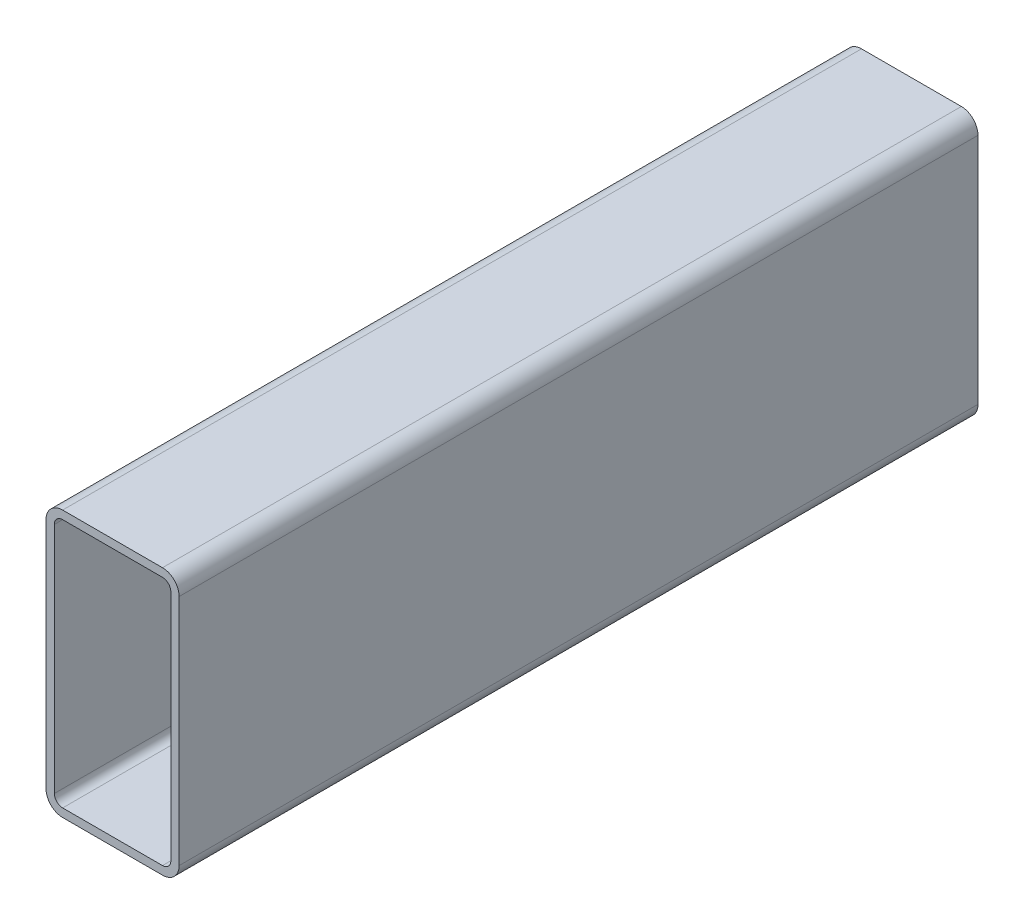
ISO-10303-21;
HEADER;
FILE_DESCRIPTION(('STEP AP214'),'2;1');
FILE_NAME('part.step','',(''),(''),'','','');
FILE_SCHEMA(('AUTOMOTIVE_DESIGN { 1 0 10303 214 1 1 1 1 }'));
ENDSEC;
DATA;
#1=APPLICATION_CONTEXT('core data for automotive mechanical design processes');
#2=APPLICATION_PROTOCOL_DEFINITION('international standard','automotive_design',2000,#1);
#3=PRODUCT_CONTEXT('',#1,'mechanical');
#4=PRODUCT('Part','Part','',(#3));
#5=PRODUCT_RELATED_PRODUCT_CATEGORY('part','',(#4));
#6=PRODUCT_DEFINITION_FORMATION('','',#4);
#7=PRODUCT_DEFINITION_CONTEXT('part definition',#1,'design');
#8=PRODUCT_DEFINITION('design','',#6,#7);
#9=PRODUCT_DEFINITION_SHAPE('','',#8);
#10=(LENGTH_UNIT() NAMED_UNIT(*) SI_UNIT(.MILLI.,.METRE.));
#11=(NAMED_UNIT(*) PLANE_ANGLE_UNIT() SI_UNIT($,.RADIAN.));
#12=(NAMED_UNIT(*) SI_UNIT($,.STERADIAN.) SOLID_ANGLE_UNIT());
#13=UNCERTAINTY_MEASURE_WITH_UNIT(LENGTH_MEASURE(1.E-05),#10,'distance_accuracy_value','');
#14=(GEOMETRIC_REPRESENTATION_CONTEXT(3) GLOBAL_UNCERTAINTY_ASSIGNED_CONTEXT((#13)) GLOBAL_UNIT_ASSIGNED_CONTEXT((#10,
#11,#12)) REPRESENTATION_CONTEXT('',''));
#15=CARTESIAN_POINT('',(0.,0.,0.));
#16=DIRECTION('',(0.,0.,1.));
#17=DIRECTION('',(1.,0.,0.));
#18=AXIS2_PLACEMENT_3D('',#15,#16,#17);
#19=CARTESIAN_POINT('',(6.35,95.25,304.8));
#20=DIRECTION('',(0.,0.,1.));
#21=DIRECTION('',(1.,0.,0.));
#22=AXIS2_PLACEMENT_3D('',#19,#20,#21);
#23=PLANE('',#22);
#24=CARTESIAN_POINT('',(6.35,95.25,304.8));
#25=DIRECTION('',(0.,0.,1.));
#26=DIRECTION('',(1.,0.,0.));
#27=AXIS2_PLACEMENT_3D('',#24,#25,#26);
#28=CIRCLE('',#27,6.35);
#29=CARTESIAN_POINT('',(6.35,101.6,304.8));
#30=VERTEX_POINT('',#29);
#31=CARTESIAN_POINT('',(0.,95.25,304.8));
#32=VERTEX_POINT('',#31);
#33=EDGE_CURVE('E211',#30,#32,#28,.T.);
#34=ORIENTED_EDGE('',*,*,#33,.T.);
#35=DIRECTION('',(0.,-1.,0.));
#36=VECTOR('',#35,1.);
#37=CARTESIAN_POINT('',(0.,6.35,304.8));
#38=LINE('',#37,#36);
#39=CARTESIAN_POINT('',(0.,6.35,304.8));
#40=VERTEX_POINT('',#39);
#41=EDGE_CURVE('E214',#32,#40,#38,.T.);
#42=ORIENTED_EDGE('',*,*,#41,.T.);
#43=CARTESIAN_POINT('',(6.35,6.35,304.8));
#44=DIRECTION('',(0.,0.,1.));
#45=DIRECTION('',(1.,0.,0.));
#46=AXIS2_PLACEMENT_3D('',#43,#44,#45);
#47=CIRCLE('',#46,6.35);
#48=CARTESIAN_POINT('',(6.35,0.,304.8));
#49=VERTEX_POINT('',#48);
#50=EDGE_CURVE('E217',#40,#49,#47,.T.);
#51=ORIENTED_EDGE('',*,*,#50,.T.);
#52=DIRECTION('',(1.,0.,0.));
#53=VECTOR('',#52,1.);
#54=CARTESIAN_POINT('',(44.45,0.,304.8));
#55=LINE('',#54,#53);
#56=CARTESIAN_POINT('',(44.45,0.,304.8));
#57=VERTEX_POINT('',#56);
#58=EDGE_CURVE('E219',#49,#57,#55,.T.);
#59=ORIENTED_EDGE('',*,*,#58,.T.);
#60=CARTESIAN_POINT('',(44.45,6.35,304.8));
#61=DIRECTION('',(0.,0.,1.));
#62=DIRECTION('',(1.,0.,0.));
#63=AXIS2_PLACEMENT_3D('',#60,#61,#62);
#64=CIRCLE('',#63,6.35);
#65=CARTESIAN_POINT('',(50.8,6.35,304.8));
#66=VERTEX_POINT('',#65);
#67=EDGE_CURVE('E221',#57,#66,#64,.T.);
#68=ORIENTED_EDGE('',*,*,#67,.T.);
#69=DIRECTION('',(0.,1.,0.));
#70=VECTOR('',#69,1.);
#71=CARTESIAN_POINT('',(50.8,95.25,304.8));
#72=LINE('',#71,#70);
#73=CARTESIAN_POINT('',(50.8,95.25,304.8));
#74=VERTEX_POINT('',#73);
#75=EDGE_CURVE('E223',#66,#74,#72,.T.);
#76=ORIENTED_EDGE('',*,*,#75,.T.);
#77=CARTESIAN_POINT('',(44.45,95.25,304.8));
#78=DIRECTION('',(0.,0.,1.));
#79=DIRECTION('',(1.,0.,0.));
#80=AXIS2_PLACEMENT_3D('',#77,#78,#79);
#81=CIRCLE('',#80,6.35000000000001);
#82=CARTESIAN_POINT('',(44.45,101.6,304.8));
#83=VERTEX_POINT('',#82);
#84=EDGE_CURVE('E225',#74,#83,#81,.T.);
#85=ORIENTED_EDGE('',*,*,#84,.T.);
#86=DIRECTION('',(-1.,0.,0.));
#87=VECTOR('',#86,1.);
#88=CARTESIAN_POINT('',(6.35,101.6,304.8));
#89=LINE('',#88,#87);
#90=EDGE_CURVE('E227',#83,#30,#89,.T.);
#91=ORIENTED_EDGE('',*,*,#90,.T.);
#92=EDGE_LOOP('',(#34,#42,#51,#59,#68,#76,#85,#91));
#93=FACE_BOUND('',#92,.T.);
#94=DIRECTION('',(0.,-1.,0.));
#95=VECTOR('',#94,1.);
#96=CARTESIAN_POINT('',(3.175,6.35,304.8));
#97=LINE('',#96,#95);
#98=CARTESIAN_POINT('',(3.175,95.25,304.8));
#99=VERTEX_POINT('',#98);
#100=CARTESIAN_POINT('',(3.175,6.35,304.8));
#101=VERTEX_POINT('',#100);
#102=EDGE_CURVE('E154',#99,#101,#97,.T.);
#103=ORIENTED_EDGE('',*,*,#102,.F.);
#104=CARTESIAN_POINT('',(6.35,95.25,304.8));
#105=DIRECTION('',(0.,0.,1.));
#106=DIRECTION('',(1.,0.,0.));
#107=AXIS2_PLACEMENT_3D('',#104,#105,#106);
#108=CIRCLE('',#107,3.17500000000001);
#109=CARTESIAN_POINT('',(6.35,98.425,304.8));
#110=VERTEX_POINT('',#109);
#111=EDGE_CURVE('E146',#110,#99,#108,.T.);
#112=ORIENTED_EDGE('',*,*,#111,.F.);
#113=DIRECTION('',(-1.,0.,0.));
#114=VECTOR('',#113,1.);
#115=CARTESIAN_POINT('',(6.35,98.425,304.8));
#116=LINE('',#115,#114);
#117=CARTESIAN_POINT('',(44.45,98.425,304.8));
#118=VERTEX_POINT('',#117);
#119=EDGE_CURVE('E179',#118,#110,#116,.T.);
#120=ORIENTED_EDGE('',*,*,#119,.F.);
#121=CARTESIAN_POINT('',(44.45,95.25,304.8));
#122=DIRECTION('',(0.,0.,1.));
#123=DIRECTION('',(1.,0.,0.));
#124=AXIS2_PLACEMENT_3D('',#121,#122,#123);
#125=CIRCLE('',#124,3.17500000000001);
#126=CARTESIAN_POINT('',(47.625,95.25,304.8));
#127=VERTEX_POINT('',#126);
#128=EDGE_CURVE('E177',#127,#118,#125,.T.);
#129=ORIENTED_EDGE('',*,*,#128,.F.);
#130=DIRECTION('',(0.,1.,0.));
#131=VECTOR('',#130,1.);
#132=CARTESIAN_POINT('',(47.625,95.25,304.8));
#133=LINE('',#132,#131);
#134=CARTESIAN_POINT('',(47.625,6.35,304.8));
#135=VERTEX_POINT('',#134);
#136=EDGE_CURVE('E175',#135,#127,#133,.T.);
#137=ORIENTED_EDGE('',*,*,#136,.F.);
#138=CARTESIAN_POINT('',(44.45,6.35,304.8));
#139=DIRECTION('',(0.,0.,1.));
#140=DIRECTION('',(1.,0.,0.));
#141=AXIS2_PLACEMENT_3D('',#138,#139,#140);
#142=CIRCLE('',#141,3.175);
#143=CARTESIAN_POINT('',(44.45,3.175,304.8));
#144=VERTEX_POINT('',#143);
#145=EDGE_CURVE('E173',#144,#135,#142,.T.);
#146=ORIENTED_EDGE('',*,*,#145,.F.);
#147=DIRECTION('',(1.,0.,0.));
#148=VECTOR('',#147,1.);
#149=CARTESIAN_POINT('',(44.45,3.175,304.8));
#150=LINE('',#149,#148);
#151=CARTESIAN_POINT('',(6.35,3.175,304.8));
#152=VERTEX_POINT('',#151);
#153=EDGE_CURVE('E169',#152,#144,#150,.T.);
#154=ORIENTED_EDGE('',*,*,#153,.F.);
#155=CARTESIAN_POINT('',(6.35,6.35,304.8));
#156=DIRECTION('',(0.,0.,1.));
#157=DIRECTION('',(1.,0.,0.));
#158=AXIS2_PLACEMENT_3D('',#155,#156,#157);
#159=CIRCLE('',#158,3.175);
#160=EDGE_CURVE('E167',#101,#152,#159,.T.);
#161=ORIENTED_EDGE('',*,*,#160,.F.);
#162=EDGE_LOOP('',(#103,#112,#120,#129,#137,#146,#154,#161));
#163=FACE_BOUND('',#162,.T.);
#164=ADVANCED_FACE('F33',(#93,#163),#23,.T.);
#165=CARTESIAN_POINT('',(6.35,95.25,0.));
#166=DIRECTION('',(0.,0.,1.));
#167=DIRECTION('',(1.,0.,0.));
#168=AXIS2_PLACEMENT_3D('',#165,#166,#167);
#169=PLANE('',#168);
#170=CARTESIAN_POINT('',(6.35,95.25,0.));
#171=DIRECTION('',(0.,0.,1.));
#172=DIRECTION('',(1.,0.,0.));
#173=AXIS2_PLACEMENT_3D('',#170,#171,#172);
#174=CIRCLE('',#173,6.35);
#175=CARTESIAN_POINT('',(6.35,101.6,0.));
#176=VERTEX_POINT('',#175);
#177=CARTESIAN_POINT('',(0.,95.25,0.));
#178=VERTEX_POINT('',#177);
#179=EDGE_CURVE('E162',#176,#178,#174,.T.);
#180=ORIENTED_EDGE('',*,*,#179,.F.);
#181=DIRECTION('',(-1.,0.,0.));
#182=VECTOR('',#181,1.);
#183=CARTESIAN_POINT('',(6.35,101.6,0.));
#184=LINE('',#183,#182);
#185=CARTESIAN_POINT('',(44.45,101.6,0.));
#186=VERTEX_POINT('',#185);
#187=EDGE_CURVE('E215',#186,#176,#184,.T.);
#188=ORIENTED_EDGE('',*,*,#187,.F.);
#189=CARTESIAN_POINT('',(44.45,95.25,0.));
#190=DIRECTION('',(0.,0.,1.));
#191=DIRECTION('',(1.,0.,0.));
#192=AXIS2_PLACEMENT_3D('',#189,#190,#191);
#193=CIRCLE('',#192,6.35000000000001);
#194=CARTESIAN_POINT('',(50.8,95.25,0.));
#195=VERTEX_POINT('',#194);
#196=EDGE_CURVE('E242',#195,#186,#193,.T.);
#197=ORIENTED_EDGE('',*,*,#196,.F.);
#198=DIRECTION('',(0.,1.,0.));
#199=VECTOR('',#198,1.);
#200=CARTESIAN_POINT('',(50.8,95.25,0.));
#201=LINE('',#200,#199);
#202=CARTESIAN_POINT('',(50.8,6.35,0.));
#203=VERTEX_POINT('',#202);
#204=EDGE_CURVE('E240',#203,#195,#201,.T.);
#205=ORIENTED_EDGE('',*,*,#204,.F.);
#206=CARTESIAN_POINT('',(44.45,6.35,0.));
#207=DIRECTION('',(0.,0.,1.));
#208=DIRECTION('',(1.,0.,0.));
#209=AXIS2_PLACEMENT_3D('',#206,#207,#208);
#210=CIRCLE('',#209,6.35);
#211=CARTESIAN_POINT('',(44.45,0.,0.));
#212=VERTEX_POINT('',#211);
#213=EDGE_CURVE('E238',#212,#203,#210,.T.);
#214=ORIENTED_EDGE('',*,*,#213,.F.);
#215=DIRECTION('',(1.,0.,0.));
#216=VECTOR('',#215,1.);
#217=CARTESIAN_POINT('',(44.45,0.,0.));
#218=LINE('',#217,#216);
#219=CARTESIAN_POINT('',(6.35,0.,0.));
#220=VERTEX_POINT('',#219);
#221=EDGE_CURVE('E236',#220,#212,#218,.T.);
#222=ORIENTED_EDGE('',*,*,#221,.F.);
#223=CARTESIAN_POINT('',(6.35,6.35,0.));
#224=DIRECTION('',(0.,0.,1.));
#225=DIRECTION('',(1.,0.,0.));
#226=AXIS2_PLACEMENT_3D('',#223,#224,#225);
#227=CIRCLE('',#226,6.35);
#228=CARTESIAN_POINT('',(0.,6.35,0.));
#229=VERTEX_POINT('',#228);
#230=EDGE_CURVE('E234',#229,#220,#227,.T.);
#231=ORIENTED_EDGE('',*,*,#230,.F.);
#232=DIRECTION('',(0.,-1.,0.));
#233=VECTOR('',#232,1.);
#234=CARTESIAN_POINT('',(0.,6.35,0.));
#235=LINE('',#234,#233);
#236=EDGE_CURVE('E232',#178,#229,#235,.T.);
#237=ORIENTED_EDGE('',*,*,#236,.F.);
#238=EDGE_LOOP('',(#180,#188,#197,#205,#214,#222,#231,#237));
#239=FACE_BOUND('',#238,.T.);
#240=CARTESIAN_POINT('',(6.35,95.25,0.));
#241=DIRECTION('',(0.,0.,1.));
#242=DIRECTION('',(1.,0.,0.));
#243=AXIS2_PLACEMENT_3D('',#240,#241,#242);
#244=CIRCLE('',#243,3.17500000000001);
#245=CARTESIAN_POINT('',(6.35,98.425,0.));
#246=VERTEX_POINT('',#245);
#247=CARTESIAN_POINT('',(3.175,95.25,0.));
#248=VERTEX_POINT('',#247);
#249=EDGE_CURVE('E56',#246,#248,#244,.T.);
#250=ORIENTED_EDGE('',*,*,#249,.T.);
#251=DIRECTION('',(0.,-1.,0.));
#252=VECTOR('',#251,1.);
#253=CARTESIAN_POINT('',(3.175,6.35,0.));
#254=LINE('',#253,#252);
#255=CARTESIAN_POINT('',(3.175,6.35,0.));
#256=VERTEX_POINT('',#255);
#257=EDGE_CURVE('E161',#248,#256,#254,.T.);
#258=ORIENTED_EDGE('',*,*,#257,.T.);
#259=CARTESIAN_POINT('',(6.35,6.35,0.));
#260=DIRECTION('',(0.,0.,1.));
#261=DIRECTION('',(1.,0.,0.));
#262=AXIS2_PLACEMENT_3D('',#259,#260,#261);
#263=CIRCLE('',#262,3.175);
#264=CARTESIAN_POINT('',(6.35,3.175,0.));
#265=VERTEX_POINT('',#264);
#266=EDGE_CURVE('E183',#256,#265,#263,.T.);
#267=ORIENTED_EDGE('',*,*,#266,.T.);
#268=DIRECTION('',(1.,0.,0.));
#269=VECTOR('',#268,1.);
#270=CARTESIAN_POINT('',(44.45,3.175,0.));
#271=LINE('',#270,#269);
#272=CARTESIAN_POINT('',(44.45,3.175,0.));
#273=VERTEX_POINT('',#272);
#274=EDGE_CURVE('E186',#265,#273,#271,.T.);
#275=ORIENTED_EDGE('',*,*,#274,.T.);
#276=CARTESIAN_POINT('',(44.45,6.35,0.));
#277=DIRECTION('',(0.,0.,1.));
#278=DIRECTION('',(1.,0.,0.));
#279=AXIS2_PLACEMENT_3D('',#276,#277,#278);
#280=CIRCLE('',#279,3.175);
#281=CARTESIAN_POINT('',(47.625,6.35,0.));
#282=VERTEX_POINT('',#281);
#283=EDGE_CURVE('E189',#273,#282,#280,.T.);
#284=ORIENTED_EDGE('',*,*,#283,.T.);
#285=DIRECTION('',(0.,1.,0.));
#286=VECTOR('',#285,1.);
#287=CARTESIAN_POINT('',(47.625,95.25,0.));
#288=LINE('',#287,#286);
#289=CARTESIAN_POINT('',(47.625,95.25,0.));
#290=VERTEX_POINT('',#289);
#291=EDGE_CURVE('E192',#282,#290,#288,.T.);
#292=ORIENTED_EDGE('',*,*,#291,.T.);
#293=CARTESIAN_POINT('',(44.45,95.25,0.));
#294=DIRECTION('',(0.,0.,1.));
#295=DIRECTION('',(1.,0.,0.));
#296=AXIS2_PLACEMENT_3D('',#293,#294,#295);
#297=CIRCLE('',#296,3.17500000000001);
#298=CARTESIAN_POINT('',(44.45,98.425,0.));
#299=VERTEX_POINT('',#298);
#300=EDGE_CURVE('E195',#290,#299,#297,.T.);
#301=ORIENTED_EDGE('',*,*,#300,.T.);
#302=DIRECTION('',(-1.,0.,0.));
#303=VECTOR('',#302,1.);
#304=CARTESIAN_POINT('',(6.35,98.425,0.));
#305=LINE('',#304,#303);
#306=EDGE_CURVE('E155',#299,#246,#305,.T.);
#307=ORIENTED_EDGE('',*,*,#306,.T.);
#308=EDGE_LOOP('',(#250,#258,#267,#275,#284,#292,#301,#307));
#309=FACE_BOUND('',#308,.T.);
#310=ADVANCED_FACE('F272',(#239,#309),#169,.F.);
#311=CARTESIAN_POINT('',(6.35,95.25,304.8));
#312=DIRECTION('',(0.,0.,-1.));
#313=DIRECTION('',(-1.,0.,0.));
#314=AXIS2_PLACEMENT_3D('',#311,#312,#313);
#315=CYLINDRICAL_SURFACE('',#314,6.35);
#316=ORIENTED_EDGE('',*,*,#179,.T.);
#317=DIRECTION('',(0.,0.,-1.));
#318=VECTOR('',#317,1.);
#319=CARTESIAN_POINT('',(0.,95.25,304.8));
#320=LINE('',#319,#318);
#321=EDGE_CURVE('E11',#32,#178,#320,.T.);
#322=ORIENTED_EDGE('',*,*,#321,.F.);
#323=ORIENTED_EDGE('',*,*,#33,.F.);
#324=DIRECTION('',(0.,0.,-1.));
#325=VECTOR('',#324,1.);
#326=CARTESIAN_POINT('',(6.35,101.6,304.8));
#327=LINE('',#326,#325);
#328=EDGE_CURVE('E229',#30,#176,#327,.T.);
#329=ORIENTED_EDGE('',*,*,#328,.T.);
#330=EDGE_LOOP('',(#316,#322,#323,#329));
#331=FACE_BOUND('',#330,.T.);
#332=ADVANCED_FACE('F35',(#331),#315,.T.);
#333=CARTESIAN_POINT('',(0.,6.35,304.8));
#334=DIRECTION('',(1.,0.,0.));
#335=DIRECTION('',(0.,0.,-1.));
#336=AXIS2_PLACEMENT_3D('',#333,#334,#335);
#337=PLANE('',#336);
#338=ORIENTED_EDGE('',*,*,#236,.T.);
#339=DIRECTION('',(0.,0.,-1.));
#340=VECTOR('',#339,1.);
#341=CARTESIAN_POINT('',(0.,6.35,304.8));
#342=LINE('',#341,#340);
#343=EDGE_CURVE('E41',#40,#229,#342,.T.);
#344=ORIENTED_EDGE('',*,*,#343,.F.);
#345=ORIENTED_EDGE('',*,*,#41,.F.);
#346=ORIENTED_EDGE('',*,*,#321,.T.);
#347=EDGE_LOOP('',(#338,#344,#345,#346));
#348=FACE_BOUND('',#347,.T.);
#349=ADVANCED_FACE('F289',(#348),#337,.F.);
#350=CARTESIAN_POINT('',(6.35,6.35,304.8));
#351=DIRECTION('',(0.,0.,-1.));
#352=DIRECTION('',(-1.,0.,0.));
#353=AXIS2_PLACEMENT_3D('',#350,#351,#352);
#354=CYLINDRICAL_SURFACE('',#353,6.35);
#355=ORIENTED_EDGE('',*,*,#230,.T.);
#356=DIRECTION('',(0.,0.,-1.));
#357=VECTOR('',#356,1.);
#358=CARTESIAN_POINT('',(6.35,0.,304.8));
#359=LINE('',#358,#357);
#360=EDGE_CURVE('E259',#49,#220,#359,.T.);
#361=ORIENTED_EDGE('',*,*,#360,.F.);
#362=ORIENTED_EDGE('',*,*,#50,.F.);
#363=ORIENTED_EDGE('',*,*,#343,.T.);
#364=EDGE_LOOP('',(#355,#361,#362,#363));
#365=FACE_BOUND('',#364,.T.);
#366=ADVANCED_FACE('F266',(#365),#354,.T.);
#367=CARTESIAN_POINT('',(44.45,0.,304.8));
#368=DIRECTION('',(0.,1.,0.));
#369=DIRECTION('',(0.,0.,1.));
#370=AXIS2_PLACEMENT_3D('',#367,#368,#369);
#371=PLANE('',#370);
#372=ORIENTED_EDGE('',*,*,#221,.T.);
#373=DIRECTION('',(0.,0.,-1.));
#374=VECTOR('',#373,1.);
#375=CARTESIAN_POINT('',(44.45,0.,304.8));
#376=LINE('',#375,#374);
#377=EDGE_CURVE('E256',#57,#212,#376,.T.);
#378=ORIENTED_EDGE('',*,*,#377,.F.);
#379=ORIENTED_EDGE('',*,*,#58,.F.);
#380=ORIENTED_EDGE('',*,*,#360,.T.);
#381=EDGE_LOOP('',(#372,#378,#379,#380));
#382=FACE_BOUND('',#381,.T.);
#383=ADVANCED_FACE('F278',(#382),#371,.F.);
#384=CARTESIAN_POINT('',(44.45,6.35,304.8));
#385=DIRECTION('',(0.,0.,-1.));
#386=DIRECTION('',(-1.,0.,0.));
#387=AXIS2_PLACEMENT_3D('',#384,#385,#386);
#388=CYLINDRICAL_SURFACE('',#387,6.35);
#389=ORIENTED_EDGE('',*,*,#213,.T.);
#390=DIRECTION('',(0.,0.,-1.));
#391=VECTOR('',#390,1.);
#392=CARTESIAN_POINT('',(50.8,6.35,304.8));
#393=LINE('',#392,#391);
#394=EDGE_CURVE('E253',#66,#203,#393,.T.);
#395=ORIENTED_EDGE('',*,*,#394,.F.);
#396=ORIENTED_EDGE('',*,*,#67,.F.);
#397=ORIENTED_EDGE('',*,*,#377,.T.);
#398=EDGE_LOOP('',(#389,#395,#396,#397));
#399=FACE_BOUND('',#398,.T.);
#400=ADVANCED_FACE('F282',(#399),#388,.T.);
#401=CARTESIAN_POINT('',(50.8,95.25,304.8));
#402=DIRECTION('',(-1.,0.,0.));
#403=DIRECTION('',(0.,0.,1.));
#404=AXIS2_PLACEMENT_3D('',#401,#402,#403);
#405=PLANE('',#404);
#406=ORIENTED_EDGE('',*,*,#204,.T.);
#407=DIRECTION('',(0.,0.,-1.));
#408=VECTOR('',#407,1.);
#409=CARTESIAN_POINT('',(50.8,95.25,304.8));
#410=LINE('',#409,#408);
#411=EDGE_CURVE('E250',#74,#195,#410,.T.);
#412=ORIENTED_EDGE('',*,*,#411,.F.);
#413=ORIENTED_EDGE('',*,*,#75,.F.);
#414=ORIENTED_EDGE('',*,*,#394,.T.);
#415=EDGE_LOOP('',(#406,#412,#413,#414));
#416=FACE_BOUND('',#415,.T.);
#417=ADVANCED_FACE('F302',(#416),#405,.F.);
#418=CARTESIAN_POINT('',(44.45,95.25,304.8));
#419=DIRECTION('',(0.,0.,-1.));
#420=DIRECTION('',(-1.,0.,0.));
#421=AXIS2_PLACEMENT_3D('',#418,#419,#420);
#422=CYLINDRICAL_SURFACE('',#421,6.35000000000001);
#423=ORIENTED_EDGE('',*,*,#196,.T.);
#424=DIRECTION('',(0.,0.,-1.));
#425=VECTOR('',#424,1.);
#426=CARTESIAN_POINT('',(44.45,101.6,304.8));
#427=LINE('',#426,#425);
#428=EDGE_CURVE('E247',#83,#186,#427,.T.);
#429=ORIENTED_EDGE('',*,*,#428,.F.);
#430=ORIENTED_EDGE('',*,*,#84,.F.);
#431=ORIENTED_EDGE('',*,*,#411,.T.);
#432=EDGE_LOOP('',(#423,#429,#430,#431));
#433=FACE_BOUND('',#432,.T.);
#434=ADVANCED_FACE('F300',(#433),#422,.T.);
#435=CARTESIAN_POINT('',(6.35,101.6,304.8));
#436=DIRECTION('',(0.,-1.,0.));
#437=DIRECTION('',(0.,0.,-1.));
#438=AXIS2_PLACEMENT_3D('',#435,#436,#437);
#439=PLANE('',#438);
#440=ORIENTED_EDGE('',*,*,#187,.T.);
#441=ORIENTED_EDGE('',*,*,#328,.F.);
#442=ORIENTED_EDGE('',*,*,#90,.F.);
#443=ORIENTED_EDGE('',*,*,#428,.T.);
#444=EDGE_LOOP('',(#440,#441,#442,#443));
#445=FACE_BOUND('',#444,.T.);
#446=ADVANCED_FACE('F295',(#445),#439,.F.);
#447=CARTESIAN_POINT('',(6.35,95.25,304.8));
#448=DIRECTION('',(0.,0.,-1.));
#449=DIRECTION('',(-1.,0.,0.));
#450=AXIS2_PLACEMENT_3D('',#447,#448,#449);
#451=CYLINDRICAL_SURFACE('',#450,3.17500000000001);
#452=ORIENTED_EDGE('',*,*,#249,.F.);
#453=DIRECTION('',(0.,0.,-1.));
#454=VECTOR('',#453,1.);
#455=CARTESIAN_POINT('',(6.35,98.425,304.8));
#456=LINE('',#455,#454);
#457=EDGE_CURVE('E150',#110,#246,#456,.T.);
#458=ORIENTED_EDGE('',*,*,#457,.F.);
#459=ORIENTED_EDGE('',*,*,#111,.T.);
#460=DIRECTION('',(0.,0.,-1.));
#461=VECTOR('',#460,1.);
#462=CARTESIAN_POINT('',(3.175,95.25,304.8));
#463=LINE('',#462,#461);
#464=EDGE_CURVE('E149',#99,#248,#463,.T.);
#465=ORIENTED_EDGE('',*,*,#464,.T.);
#466=EDGE_LOOP('',(#452,#458,#459,#465));
#467=FACE_BOUND('',#466,.T.);
#468=ADVANCED_FACE('F148',(#467),#451,.F.);
#469=CARTESIAN_POINT('',(3.175,6.35,304.8));
#470=DIRECTION('',(1.,0.,0.));
#471=DIRECTION('',(0.,0.,-1.));
#472=AXIS2_PLACEMENT_3D('',#469,#470,#471);
#473=PLANE('',#472);
#474=ORIENTED_EDGE('',*,*,#257,.F.);
#475=ORIENTED_EDGE('',*,*,#464,.F.);
#476=ORIENTED_EDGE('',*,*,#102,.T.);
#477=DIRECTION('',(0.,0.,-1.));
#478=VECTOR('',#477,1.);
#479=CARTESIAN_POINT('',(3.175,6.35,304.8));
#480=LINE('',#479,#478);
#481=EDGE_CURVE('E163',#101,#256,#480,.T.);
#482=ORIENTED_EDGE('',*,*,#481,.T.);
#483=EDGE_LOOP('',(#474,#475,#476,#482));
#484=FACE_BOUND('',#483,.T.);
#485=ADVANCED_FACE('F158',(#484),#473,.T.);
#486=CARTESIAN_POINT('',(6.35,6.35,304.8));
#487=DIRECTION('',(0.,0.,-1.));
#488=DIRECTION('',(-1.,0.,0.));
#489=AXIS2_PLACEMENT_3D('',#486,#487,#488);
#490=CYLINDRICAL_SURFACE('',#489,3.175);
#491=ORIENTED_EDGE('',*,*,#266,.F.);
#492=ORIENTED_EDGE('',*,*,#481,.F.);
#493=ORIENTED_EDGE('',*,*,#160,.T.);
#494=DIRECTION('',(0.,0.,-1.));
#495=VECTOR('',#494,1.);
#496=CARTESIAN_POINT('',(6.35,3.175,304.8));
#497=LINE('',#496,#495);
#498=EDGE_CURVE('E208',#152,#265,#497,.T.);
#499=ORIENTED_EDGE('',*,*,#498,.T.);
#500=EDGE_LOOP('',(#491,#492,#493,#499));
#501=FACE_BOUND('',#500,.T.);
#502=ADVANCED_FACE('F327',(#501),#490,.F.);
#503=CARTESIAN_POINT('',(44.45,3.175,304.8));
#504=DIRECTION('',(0.,1.,0.));
#505=DIRECTION('',(0.,0.,1.));
#506=AXIS2_PLACEMENT_3D('',#503,#504,#505);
#507=PLANE('',#506);
#508=ORIENTED_EDGE('',*,*,#274,.F.);
#509=ORIENTED_EDGE('',*,*,#498,.F.);
#510=ORIENTED_EDGE('',*,*,#153,.T.);
#511=DIRECTION('',(0.,0.,-1.));
#512=VECTOR('',#511,1.);
#513=CARTESIAN_POINT('',(44.45,3.175,304.8));
#514=LINE('',#513,#512);
#515=EDGE_CURVE('E206',#144,#273,#514,.T.);
#516=ORIENTED_EDGE('',*,*,#515,.T.);
#517=EDGE_LOOP('',(#508,#509,#510,#516));
#518=FACE_BOUND('',#517,.T.);
#519=ADVANCED_FACE('F331',(#518),#507,.T.);
#520=CARTESIAN_POINT('',(44.45,6.35,304.8));
#521=DIRECTION('',(0.,0.,-1.));
#522=DIRECTION('',(-1.,0.,0.));
#523=AXIS2_PLACEMENT_3D('',#520,#521,#522);
#524=CYLINDRICAL_SURFACE('',#523,3.175);
#525=ORIENTED_EDGE('',*,*,#283,.F.);
#526=ORIENTED_EDGE('',*,*,#515,.F.);
#527=ORIENTED_EDGE('',*,*,#145,.T.);
#528=DIRECTION('',(0.,0.,-1.));
#529=VECTOR('',#528,1.);
#530=CARTESIAN_POINT('',(47.625,6.35,304.8));
#531=LINE('',#530,#529);
#532=EDGE_CURVE('E204',#135,#282,#531,.T.);
#533=ORIENTED_EDGE('',*,*,#532,.T.);
#534=EDGE_LOOP('',(#525,#526,#527,#533));
#535=FACE_BOUND('',#534,.T.);
#536=ADVANCED_FACE('F337',(#535),#524,.F.);
#537=CARTESIAN_POINT('',(47.625,95.25,304.8));
#538=DIRECTION('',(-1.,0.,0.));
#539=DIRECTION('',(0.,0.,1.));
#540=AXIS2_PLACEMENT_3D('',#537,#538,#539);
#541=PLANE('',#540);
#542=ORIENTED_EDGE('',*,*,#291,.F.);
#543=ORIENTED_EDGE('',*,*,#532,.F.);
#544=ORIENTED_EDGE('',*,*,#136,.T.);
#545=DIRECTION('',(0.,0.,-1.));
#546=VECTOR('',#545,1.);
#547=CARTESIAN_POINT('',(47.625,95.25,304.8));
#548=LINE('',#547,#546);
#549=EDGE_CURVE('E202',#127,#290,#548,.T.);
#550=ORIENTED_EDGE('',*,*,#549,.T.);
#551=EDGE_LOOP('',(#542,#543,#544,#550));
#552=FACE_BOUND('',#551,.T.);
#553=ADVANCED_FACE('F341',(#552),#541,.T.);
#554=CARTESIAN_POINT('',(44.45,95.25,304.8));
#555=DIRECTION('',(0.,0.,-1.));
#556=DIRECTION('',(-1.,0.,0.));
#557=AXIS2_PLACEMENT_3D('',#554,#555,#556);
#558=CYLINDRICAL_SURFACE('',#557,3.17500000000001);
#559=ORIENTED_EDGE('',*,*,#300,.F.);
#560=ORIENTED_EDGE('',*,*,#549,.F.);
#561=ORIENTED_EDGE('',*,*,#128,.T.);
#562=DIRECTION('',(0.,0.,-1.));
#563=VECTOR('',#562,1.);
#564=CARTESIAN_POINT('',(44.45,98.425,304.8));
#565=LINE('',#564,#563);
#566=EDGE_CURVE('E48',#118,#299,#565,.T.);
#567=ORIENTED_EDGE('',*,*,#566,.T.);
#568=EDGE_LOOP('',(#559,#560,#561,#567));
#569=FACE_BOUND('',#568,.T.);
#570=ADVANCED_FACE('F345',(#569),#558,.F.);
#571=CARTESIAN_POINT('',(6.35,98.425,304.8));
#572=DIRECTION('',(0.,-1.,0.));
#573=DIRECTION('',(0.,0.,-1.));
#574=AXIS2_PLACEMENT_3D('',#571,#572,#573);
#575=PLANE('',#574);
#576=ORIENTED_EDGE('',*,*,#306,.F.);
#577=ORIENTED_EDGE('',*,*,#566,.F.);
#578=ORIENTED_EDGE('',*,*,#119,.T.);
#579=ORIENTED_EDGE('',*,*,#457,.T.);
#580=EDGE_LOOP('',(#576,#577,#578,#579));
#581=FACE_BOUND('',#580,.T.);
#582=ADVANCED_FACE('F349',(#581),#575,.T.);
#583=CLOSED_SHELL('',(#164,#310,#332,#349,#366,#383,#400,#417,#434,#446,#468,#485,#502,#519,
#536,#553,#570,#582));
#584=MANIFOLD_SOLID_BREP('B2',#583);
#585=ADVANCED_BREP_SHAPE_REPRESENTATION('',(#18,#584),#14);
#586=SHAPE_DEFINITION_REPRESENTATION(#9,#585);
ENDSEC;
END-ISO-10303-21;
